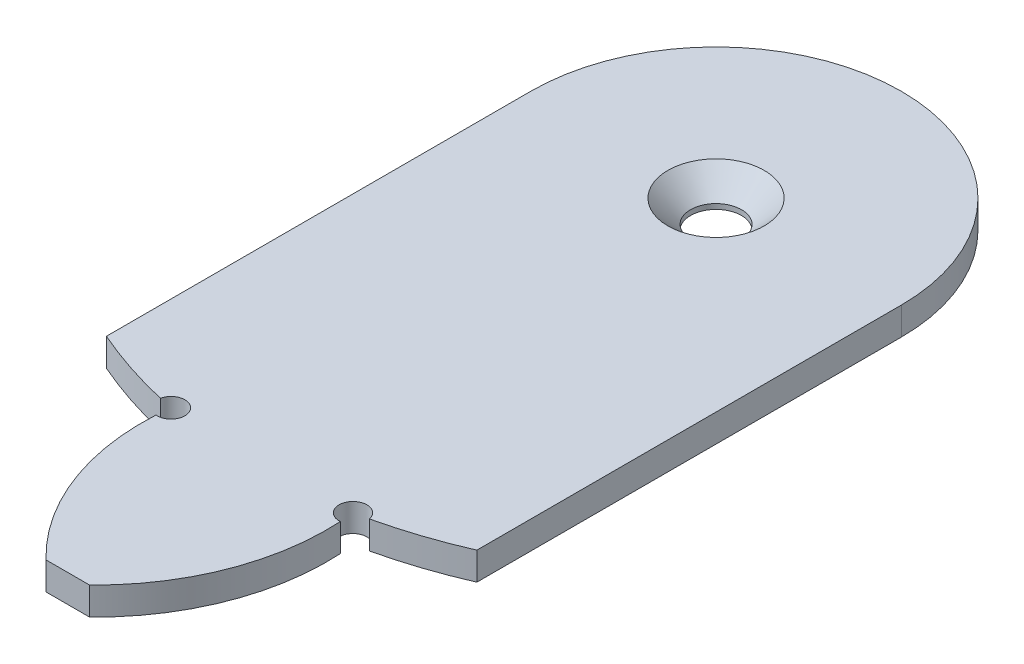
ISO-10303-21;
HEADER;
FILE_DESCRIPTION(('STEP AP214'),'2;1');
FILE_NAME('part.step','',(''),(''),'','','');
FILE_SCHEMA(('AUTOMOTIVE_DESIGN { 1 0 10303 214 1 1 1 1 }'));
ENDSEC;
DATA;
#1=APPLICATION_CONTEXT('core data for automotive mechanical design processes');
#2=APPLICATION_PROTOCOL_DEFINITION('international standard','automotive_design',2000,#1);
#3=PRODUCT_CONTEXT('',#1,'mechanical');
#4=PRODUCT('Part','Part','',(#3));
#5=PRODUCT_RELATED_PRODUCT_CATEGORY('part','',(#4));
#6=PRODUCT_DEFINITION_FORMATION('','',#4);
#7=PRODUCT_DEFINITION_CONTEXT('part definition',#1,'design');
#8=PRODUCT_DEFINITION('design','',#6,#7);
#9=PRODUCT_DEFINITION_SHAPE('','',#8);
#10=(LENGTH_UNIT() NAMED_UNIT(*) SI_UNIT(.MILLI.,.METRE.));
#11=(NAMED_UNIT(*) PLANE_ANGLE_UNIT() SI_UNIT($,.RADIAN.));
#12=(NAMED_UNIT(*) SI_UNIT($,.STERADIAN.) SOLID_ANGLE_UNIT());
#13=UNCERTAINTY_MEASURE_WITH_UNIT(LENGTH_MEASURE(1.E-05),#10,'distance_accuracy_value','');
#14=(GEOMETRIC_REPRESENTATION_CONTEXT(3) GLOBAL_UNCERTAINTY_ASSIGNED_CONTEXT((#13)) GLOBAL_UNIT_ASSIGNED_CONTEXT((#10,
#11,#12)) REPRESENTATION_CONTEXT('',''));
#15=CARTESIAN_POINT('',(0.,0.,0.));
#16=DIRECTION('',(0.,0.,1.));
#17=DIRECTION('',(1.,0.,0.));
#18=AXIS2_PLACEMENT_3D('',#15,#16,#17);
#19=CARTESIAN_POINT('',(15.,3.,-16.4173567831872));
#20=DIRECTION('',(0.,-1.,0.));
#21=DIRECTION('',(0.,0.,-1.));
#22=AXIS2_PLACEMENT_3D('',#19,#20,#21);
#23=CYLINDRICAL_SURFACE('',#22,25.);
#24=CARTESIAN_POINT('',(15.,0.,-16.4173567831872));
#25=DIRECTION('',(0.,1.,0.));
#26=DIRECTION('',(0.,0.,1.));
#27=AXIS2_PLACEMENT_3D('',#24,#25,#26);
#28=CIRCLE('',#27,25.);
#29=CARTESIAN_POINT('',(-9.95613776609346,0.,-17.8976229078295));
#30=VERTEX_POINT('',#29);
#31=CARTESIAN_POINT('',(-2.34935157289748,0.,1.58264321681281));
#32=VERTEX_POINT('',#31);
#33=EDGE_CURVE('E139',#30,#32,#28,.T.);
#34=ORIENTED_EDGE('',*,*,#33,.T.);
#35=DIRECTION('',(0.,-1.,0.));
#36=VECTOR('',#35,1.);
#37=CARTESIAN_POINT('',(-2.34935157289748,3.,1.58264321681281));
#38=LINE('',#37,#36);
#39=CARTESIAN_POINT('',(-2.34935157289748,3.,1.58264321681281));
#40=VERTEX_POINT('',#39);
#41=EDGE_CURVE('E11',#40,#32,#38,.T.);
#42=ORIENTED_EDGE('',*,*,#41,.F.);
#43=CARTESIAN_POINT('',(15.,3.,-16.4173567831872));
#44=DIRECTION('',(0.,1.,0.));
#45=DIRECTION('',(0.,0.,1.));
#46=AXIS2_PLACEMENT_3D('',#43,#44,#45);
#47=CIRCLE('',#46,25.);
#48=CARTESIAN_POINT('',(-9.95613776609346,3.,-17.8976229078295));
#49=VERTEX_POINT('',#48);
#50=EDGE_CURVE('E158',#49,#40,#47,.T.);
#51=ORIENTED_EDGE('',*,*,#50,.F.);
#52=DIRECTION('',(0.,-1.,0.));
#53=VECTOR('',#52,1.);
#54=CARTESIAN_POINT('',(-9.95613776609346,3.,-17.8976229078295));
#55=LINE('',#54,#53);
#56=EDGE_CURVE('E135',#49,#30,#55,.T.);
#57=ORIENTED_EDGE('',*,*,#56,.T.);
#58=EDGE_LOOP('',(#34,#42,#51,#57));
#59=FACE_BOUND('',#58,.T.);
#60=ADVANCED_FACE('F31',(#59),#23,.T.);
#61=CARTESIAN_POINT('',(-2.34935157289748,3.,1.58264321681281));
#62=DIRECTION('',(0.,0.,-1.));
#63=DIRECTION('',(-1.,0.,0.));
#64=AXIS2_PLACEMENT_3D('',#61,#62,#63);
#65=PLANE('',#64);
#66=DIRECTION('',(1.,0.,0.));
#67=VECTOR('',#66,1.);
#68=CARTESIAN_POINT('',(-2.34935157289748,0.,1.58264321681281));
#69=LINE('',#68,#67);
#70=CARTESIAN_POINT('',(2.34935157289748,0.,1.58264321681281));
#71=VERTEX_POINT('',#70);
#72=EDGE_CURVE('E142',#32,#71,#69,.T.);
#73=ORIENTED_EDGE('',*,*,#72,.T.);
#74=DIRECTION('',(0.,-1.,0.));
#75=VECTOR('',#74,1.);
#76=CARTESIAN_POINT('',(2.34935157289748,3.,1.58264321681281));
#77=LINE('',#76,#75);
#78=CARTESIAN_POINT('',(2.34935157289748,3.,1.58264321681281));
#79=VERTEX_POINT('',#78);
#80=EDGE_CURVE('E39',#79,#71,#77,.T.);
#81=ORIENTED_EDGE('',*,*,#80,.F.);
#82=DIRECTION('',(1.,0.,0.));
#83=VECTOR('',#82,1.);
#84=CARTESIAN_POINT('',(-2.34935157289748,3.,1.58264321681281));
#85=LINE('',#84,#83);
#86=EDGE_CURVE('E96',#40,#79,#85,.T.);
#87=ORIENTED_EDGE('',*,*,#86,.F.);
#88=ORIENTED_EDGE('',*,*,#41,.T.);
#89=EDGE_LOOP('',(#73,#81,#87,#88));
#90=FACE_BOUND('',#89,.T.);
#91=ADVANCED_FACE('F229',(#90),#65,.F.);
#92=CARTESIAN_POINT('',(-15.,3.,-16.4173567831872));
#93=DIRECTION('',(0.,-1.,0.));
#94=DIRECTION('',(0.,0.,-1.));
#95=AXIS2_PLACEMENT_3D('',#92,#93,#94);
#96=CYLINDRICAL_SURFACE('',#95,25.);
#97=CARTESIAN_POINT('',(-15.,0.,-16.4173567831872));
#98=DIRECTION('',(0.,1.,0.));
#99=DIRECTION('',(0.,0.,1.));
#100=AXIS2_PLACEMENT_3D('',#97,#98,#99);
#101=CIRCLE('',#100,25.);
#102=CARTESIAN_POINT('',(9.95613776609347,0.,-17.8976229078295));
#103=VERTEX_POINT('',#102);
#104=EDGE_CURVE('E145',#71,#103,#101,.T.);
#105=ORIENTED_EDGE('',*,*,#104,.T.);
#106=DIRECTION('',(0.,-1.,0.));
#107=VECTOR('',#106,1.);
#108=CARTESIAN_POINT('',(9.95613776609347,3.,-17.8976229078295));
#109=LINE('',#108,#107);
#110=CARTESIAN_POINT('',(9.95613776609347,3.,-17.8976229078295));
#111=VERTEX_POINT('',#110);
#112=EDGE_CURVE('E171',#111,#103,#109,.T.);
#113=ORIENTED_EDGE('',*,*,#112,.F.);
#114=CARTESIAN_POINT('',(-15.,3.,-16.4173567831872));
#115=DIRECTION('',(0.,1.,0.));
#116=DIRECTION('',(0.,0.,1.));
#117=AXIS2_PLACEMENT_3D('',#114,#115,#116);
#118=CIRCLE('',#117,25.);
#119=EDGE_CURVE('E179',#79,#111,#118,.T.);
#120=ORIENTED_EDGE('',*,*,#119,.F.);
#121=ORIENTED_EDGE('',*,*,#80,.T.);
#122=EDGE_LOOP('',(#105,#113,#120,#121));
#123=FACE_BOUND('',#122,.T.);
#124=ADVANCED_FACE('F177',(#123),#96,.T.);
#125=CARTESIAN_POINT('',(9.82244072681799,3.,-19.3916527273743));
#126=DIRECTION('',(0.,-1.,0.));
#127=DIRECTION('',(0.,0.,-1.));
#128=AXIS2_PLACEMENT_3D('',#125,#126,#127);
#129=CYLINDRICAL_SURFACE('',#128,1.5);
#130=CARTESIAN_POINT('',(9.82244072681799,0.,-19.3916527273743));
#131=DIRECTION('',(0.,-1.,0.));
#132=DIRECTION('',(0.,0.,1.));
#133=AXIS2_PLACEMENT_3D('',#130,#131,#132);
#134=CIRCLE('',#133,1.5);
#135=CARTESIAN_POINT('',(11.2886262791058,0.,-19.7083543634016));
#136=VERTEX_POINT('',#135);
#137=EDGE_CURVE('E147',#103,#136,#134,.T.);
#138=ORIENTED_EDGE('',*,*,#137,.T.);
#139=DIRECTION('',(0.,-1.,0.));
#140=VECTOR('',#139,1.);
#141=CARTESIAN_POINT('',(11.2886262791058,3.,-19.7083543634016));
#142=LINE('',#141,#140);
#143=CARTESIAN_POINT('',(11.2886262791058,3.,-19.7083543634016));
#144=VERTEX_POINT('',#143);
#145=EDGE_CURVE('E168',#144,#136,#142,.T.);
#146=ORIENTED_EDGE('',*,*,#145,.F.);
#147=CARTESIAN_POINT('',(9.82244072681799,3.,-19.3916527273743));
#148=DIRECTION('',(0.,-1.,0.));
#149=DIRECTION('',(0.,0.,1.));
#150=AXIS2_PLACEMENT_3D('',#147,#148,#149);
#151=CIRCLE('',#150,1.5);
#152=EDGE_CURVE('E197',#111,#144,#151,.T.);
#153=ORIENTED_EDGE('',*,*,#152,.F.);
#154=ORIENTED_EDGE('',*,*,#112,.T.);
#155=EDGE_LOOP('',(#138,#146,#153,#154));
#156=FACE_BOUND('',#155,.T.);
#157=ADVANCED_FACE('F188',(#156),#129,.F.);
#158=CARTESIAN_POINT('',(0.,3.,-68.4173567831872));
#159=DIRECTION('',(0.,-1.,0.));
#160=DIRECTION('',(0.,0.,-1.));
#161=AXIS2_PLACEMENT_3D('',#158,#159,#160);
#162=CYLINDRICAL_SURFACE('',#161,50.);
#163=CARTESIAN_POINT('',(0.,0.,-68.4173567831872));
#164=DIRECTION('',(0.,1.,0.));
#165=DIRECTION('',(0.,0.,1.));
#166=AXIS2_PLACEMENT_3D('',#163,#164,#165);
#167=CIRCLE('',#166,50.);
#168=CARTESIAN_POINT('',(20.,0.,-22.5915998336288));
#169=VERTEX_POINT('',#168);
#170=EDGE_CURVE('E149',#136,#169,#167,.T.);
#171=ORIENTED_EDGE('',*,*,#170,.T.);
#172=DIRECTION('',(0.,-1.,0.));
#173=VECTOR('',#172,1.);
#174=CARTESIAN_POINT('',(20.,3.,-22.5915998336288));
#175=LINE('',#174,#173);
#176=CARTESIAN_POINT('',(20.,3.,-22.5915998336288));
#177=VERTEX_POINT('',#176);
#178=EDGE_CURVE('E165',#177,#169,#175,.T.);
#179=ORIENTED_EDGE('',*,*,#178,.F.);
#180=CARTESIAN_POINT('',(0.,3.,-68.4173567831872));
#181=DIRECTION('',(0.,1.,0.));
#182=DIRECTION('',(0.,0.,1.));
#183=AXIS2_PLACEMENT_3D('',#180,#181,#182);
#184=CIRCLE('',#183,50.);
#185=EDGE_CURVE('E194',#144,#177,#184,.T.);
#186=ORIENTED_EDGE('',*,*,#185,.F.);
#187=ORIENTED_EDGE('',*,*,#145,.T.);
#188=EDGE_LOOP('',(#171,#179,#186,#187));
#189=FACE_BOUND('',#188,.T.);
#190=ADVANCED_FACE('F192',(#189),#162,.T.);
#191=CARTESIAN_POINT('',(20.,3.,-68.4173567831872));
#192=DIRECTION('',(-1.,0.,0.));
#193=DIRECTION('',(0.,0.,1.));
#194=AXIS2_PLACEMENT_3D('',#191,#192,#193);
#195=PLANE('',#194);
#196=DIRECTION('',(0.,0.,-1.));
#197=VECTOR('',#196,1.);
#198=CARTESIAN_POINT('',(20.,0.,-68.4173567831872));
#199=LINE('',#198,#197);
#200=CARTESIAN_POINT('',(20.,0.,-68.4173567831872));
#201=VERTEX_POINT('',#200);
#202=EDGE_CURVE('E151',#169,#201,#199,.T.);
#203=ORIENTED_EDGE('',*,*,#202,.T.);
#204=DIRECTION('',(0.,-1.,0.));
#205=VECTOR('',#204,1.);
#206=CARTESIAN_POINT('',(20.,3.,-68.4173567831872));
#207=LINE('',#206,#205);
#208=CARTESIAN_POINT('',(20.,3.,-68.4173567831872));
#209=VERTEX_POINT('',#208);
#210=EDGE_CURVE('E162',#209,#201,#207,.T.);
#211=ORIENTED_EDGE('',*,*,#210,.F.);
#212=DIRECTION('',(0.,0.,-1.));
#213=VECTOR('',#212,1.);
#214=CARTESIAN_POINT('',(20.,3.,-68.4173567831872));
#215=LINE('',#214,#213);
#216=EDGE_CURVE('E196',#177,#209,#215,.T.);
#217=ORIENTED_EDGE('',*,*,#216,.F.);
#218=ORIENTED_EDGE('',*,*,#178,.T.);
#219=EDGE_LOOP('',(#203,#211,#217,#218));
#220=FACE_BOUND('',#219,.T.);
#221=ADVANCED_FACE('F241',(#220),#195,.F.);
#222=CARTESIAN_POINT('',(0.,3.,-68.4173567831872));
#223=DIRECTION('',(0.,-1.,0.));
#224=DIRECTION('',(0.,0.,-1.));
#225=AXIS2_PLACEMENT_3D('',#222,#223,#224);
#226=CYLINDRICAL_SURFACE('',#225,20.);
#227=CARTESIAN_POINT('',(0.,0.,-68.4173567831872));
#228=DIRECTION('',(0.,1.,0.));
#229=DIRECTION('',(0.,0.,1.));
#230=AXIS2_PLACEMENT_3D('',#227,#228,#229);
#231=CIRCLE('',#230,20.);
#232=CARTESIAN_POINT('',(-20.,0.,-68.4173567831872));
#233=VERTEX_POINT('',#232);
#234=EDGE_CURVE('E153',#201,#233,#231,.T.);
#235=ORIENTED_EDGE('',*,*,#234,.T.);
#236=DIRECTION('',(0.,-1.,0.));
#237=VECTOR('',#236,1.);
#238=CARTESIAN_POINT('',(-20.,3.,-68.4173567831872));
#239=LINE('',#238,#237);
#240=CARTESIAN_POINT('',(-20.,3.,-68.4173567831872));
#241=VERTEX_POINT('',#240);
#242=EDGE_CURVE('E130',#241,#233,#239,.T.);
#243=ORIENTED_EDGE('',*,*,#242,.F.);
#244=CARTESIAN_POINT('',(0.,3.,-68.4173567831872));
#245=DIRECTION('',(0.,1.,0.));
#246=DIRECTION('',(0.,0.,1.));
#247=AXIS2_PLACEMENT_3D('',#244,#245,#246);
#248=CIRCLE('',#247,20.);
#249=EDGE_CURVE('E121',#209,#241,#248,.T.);
#250=ORIENTED_EDGE('',*,*,#249,.F.);
#251=ORIENTED_EDGE('',*,*,#210,.T.);
#252=EDGE_LOOP('',(#235,#243,#250,#251));
#253=FACE_BOUND('',#252,.T.);
#254=ADVANCED_FACE('F238',(#253),#226,.T.);
#255=CARTESIAN_POINT('',(-20.,3.,-68.4173567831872));
#256=DIRECTION('',(1.,0.,0.));
#257=DIRECTION('',(0.,0.,-1.));
#258=AXIS2_PLACEMENT_3D('',#255,#256,#257);
#259=PLANE('',#258);
#260=DIRECTION('',(0.,0.,1.));
#261=VECTOR('',#260,1.);
#262=CARTESIAN_POINT('',(-20.,0.,-68.4173567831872));
#263=LINE('',#262,#261);
#264=CARTESIAN_POINT('',(-20.,0.,-22.5915998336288));
#265=VERTEX_POINT('',#264);
#266=EDGE_CURVE('E129',#233,#265,#263,.T.);
#267=ORIENTED_EDGE('',*,*,#266,.T.);
#268=DIRECTION('',(0.,-1.,0.));
#269=VECTOR('',#268,1.);
#270=CARTESIAN_POINT('',(-20.,3.,-22.5915998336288));
#271=LINE('',#270,#269);
#272=CARTESIAN_POINT('',(-20.,3.,-22.5915998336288));
#273=VERTEX_POINT('',#272);
#274=EDGE_CURVE('E126',#273,#265,#271,.T.);
#275=ORIENTED_EDGE('',*,*,#274,.F.);
#276=DIRECTION('',(0.,0.,1.));
#277=VECTOR('',#276,1.);
#278=CARTESIAN_POINT('',(-20.,3.,-68.4173567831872));
#279=LINE('',#278,#277);
#280=EDGE_CURVE('E115',#241,#273,#279,.T.);
#281=ORIENTED_EDGE('',*,*,#280,.F.);
#282=ORIENTED_EDGE('',*,*,#242,.T.);
#283=EDGE_LOOP('',(#267,#275,#281,#282));
#284=FACE_BOUND('',#283,.T.);
#285=ADVANCED_FACE('F127',(#284),#259,.F.);
#286=CARTESIAN_POINT('',(0.,3.,-68.4173567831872));
#287=DIRECTION('',(0.,-1.,0.));
#288=DIRECTION('',(0.,0.,-1.));
#289=AXIS2_PLACEMENT_3D('',#286,#287,#288);
#290=CYLINDRICAL_SURFACE('',#289,50.);
#291=CARTESIAN_POINT('',(0.,0.,-68.4173567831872));
#292=DIRECTION('',(0.,1.,0.));
#293=DIRECTION('',(0.,0.,1.));
#294=AXIS2_PLACEMENT_3D('',#291,#292,#293);
#295=CIRCLE('',#294,50.);
#296=CARTESIAN_POINT('',(-11.2886262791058,0.,-19.7083543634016));
#297=VERTEX_POINT('',#296);
#298=EDGE_CURVE('E82',#265,#297,#295,.T.);
#299=ORIENTED_EDGE('',*,*,#298,.T.);
#300=DIRECTION('',(0.,-1.,0.));
#301=VECTOR('',#300,1.);
#302=CARTESIAN_POINT('',(-11.2886262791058,3.,-19.7083543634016));
#303=LINE('',#302,#301);
#304=CARTESIAN_POINT('',(-11.2886262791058,3.,-19.7083543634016));
#305=VERTEX_POINT('',#304);
#306=EDGE_CURVE('E131',#305,#297,#303,.T.);
#307=ORIENTED_EDGE('',*,*,#306,.F.);
#308=CARTESIAN_POINT('',(0.,3.,-68.4173567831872));
#309=DIRECTION('',(0.,1.,0.));
#310=DIRECTION('',(0.,0.,1.));
#311=AXIS2_PLACEMENT_3D('',#308,#309,#310);
#312=CIRCLE('',#311,50.);
#313=EDGE_CURVE('E119',#273,#305,#312,.T.);
#314=ORIENTED_EDGE('',*,*,#313,.F.);
#315=ORIENTED_EDGE('',*,*,#274,.T.);
#316=EDGE_LOOP('',(#299,#307,#314,#315));
#317=FACE_BOUND('',#316,.T.);
#318=ADVANCED_FACE('F133',(#317),#290,.T.);
#319=CARTESIAN_POINT('',(-9.82244072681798,3.,-19.3916527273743));
#320=DIRECTION('',(0.,-1.,0.));
#321=DIRECTION('',(0.,0.,-1.));
#322=AXIS2_PLACEMENT_3D('',#319,#320,#321);
#323=CYLINDRICAL_SURFACE('',#322,1.5);
#324=CARTESIAN_POINT('',(-9.82244072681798,0.,-19.3916527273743));
#325=DIRECTION('',(0.,-1.,0.));
#326=DIRECTION('',(0.,0.,1.));
#327=AXIS2_PLACEMENT_3D('',#324,#325,#326);
#328=CIRCLE('',#327,1.5);
#329=EDGE_CURVE('E88',#297,#30,#328,.T.);
#330=ORIENTED_EDGE('',*,*,#329,.T.);
#331=ORIENTED_EDGE('',*,*,#56,.F.);
#332=CARTESIAN_POINT('',(-9.82244072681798,3.,-19.3916527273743));
#333=DIRECTION('',(0.,-1.,0.));
#334=DIRECTION('',(0.,0.,1.));
#335=AXIS2_PLACEMENT_3D('',#332,#333,#334);
#336=CIRCLE('',#335,1.5);
#337=EDGE_CURVE('E47',#305,#49,#336,.T.);
#338=ORIENTED_EDGE('',*,*,#337,.F.);
#339=ORIENTED_EDGE('',*,*,#306,.T.);
#340=EDGE_LOOP('',(#330,#331,#338,#339));
#341=FACE_BOUND('',#340,.T.);
#342=ADVANCED_FACE('F217',(#341),#323,.F.);
#343=CARTESIAN_POINT('',(15.,3.,-16.4173567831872));
#344=DIRECTION('',(0.,1.,0.));
#345=DIRECTION('',(0.,0.,1.));
#346=AXIS2_PLACEMENT_3D('',#343,#344,#345);
#347=PLANE('',#346);
#348=CARTESIAN_POINT('',(0.,3.,-68.4173567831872));
#349=DIRECTION('',(0.,1.,0.));
#350=DIRECTION('',(0.,0.,1.));
#351=AXIS2_PLACEMENT_3D('',#348,#349,#350);
#352=CIRCLE('',#351,5.2);
#353=CARTESIAN_POINT('',(0.,3.,-63.2173567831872));
#354=VERTEX_POINT('',#353);
#355=EDGE_CURVE('E210',#354,#354,#352,.T.);
#356=ORIENTED_EDGE('',*,*,#355,.F.);
#357=EDGE_LOOP('',(#356));
#358=FACE_BOUND('',#357,.T.);
#359=ORIENTED_EDGE('',*,*,#50,.T.);
#360=ORIENTED_EDGE('',*,*,#86,.T.);
#361=ORIENTED_EDGE('',*,*,#119,.T.);
#362=ORIENTED_EDGE('',*,*,#152,.T.);
#363=ORIENTED_EDGE('',*,*,#185,.T.);
#364=ORIENTED_EDGE('',*,*,#216,.T.);
#365=ORIENTED_EDGE('',*,*,#249,.T.);
#366=ORIENTED_EDGE('',*,*,#280,.T.);
#367=ORIENTED_EDGE('',*,*,#313,.T.);
#368=ORIENTED_EDGE('',*,*,#337,.T.);
#369=EDGE_LOOP('',(#359,#360,#361,#362,#363,#364,#365,#366,#367,#368));
#370=FACE_BOUND('',#369,.T.);
#371=ADVANCED_FACE('F117',(#358,#370),#347,.T.);
#372=CARTESIAN_POINT('',(15.,0.,-16.4173567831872));
#373=DIRECTION('',(0.,1.,0.));
#374=DIRECTION('',(0.,0.,1.));
#375=AXIS2_PLACEMENT_3D('',#372,#373,#374);
#376=PLANE('',#375);
#377=CARTESIAN_POINT('',(0.,0.,-68.4173567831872));
#378=DIRECTION('',(0.,1.,0.));
#379=DIRECTION('',(0.,0.,1.));
#380=AXIS2_PLACEMENT_3D('',#377,#378,#379);
#381=CIRCLE('',#380,2.75);
#382=CARTESIAN_POINT('',(0.,0.,-65.6673567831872));
#383=VERTEX_POINT('',#382);
#384=EDGE_CURVE('E143',#383,#383,#381,.T.);
#385=ORIENTED_EDGE('',*,*,#384,.T.);
#386=EDGE_LOOP('',(#385));
#387=FACE_BOUND('',#386,.T.);
#388=ORIENTED_EDGE('',*,*,#33,.F.);
#389=ORIENTED_EDGE('',*,*,#329,.F.);
#390=ORIENTED_EDGE('',*,*,#298,.F.);
#391=ORIENTED_EDGE('',*,*,#266,.F.);
#392=ORIENTED_EDGE('',*,*,#234,.F.);
#393=ORIENTED_EDGE('',*,*,#202,.F.);
#394=ORIENTED_EDGE('',*,*,#170,.F.);
#395=ORIENTED_EDGE('',*,*,#137,.F.);
#396=ORIENTED_EDGE('',*,*,#104,.F.);
#397=ORIENTED_EDGE('',*,*,#72,.F.);
#398=EDGE_LOOP('',(#388,#389,#390,#391,#392,#393,#394,#395,#396,#397));
#399=FACE_BOUND('',#398,.T.);
#400=ADVANCED_FACE('F183',(#387,#399),#376,.F.);
#401=CARTESIAN_POINT('',(0.,3.,-68.4173567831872));
#402=DIRECTION('',(0.,1.,0.));
#403=DIRECTION('',(0.,0.,1.));
#404=AXIS2_PLACEMENT_3D('',#401,#402,#403);
#405=CYLINDRICAL_SURFACE('',#404,2.75);
#406=ORIENTED_EDGE('',*,*,#384,.F.);
#407=EDGE_LOOP('',(#406));
#408=FACE_BOUND('',#407,.T.);
#409=CARTESIAN_POINT('',(0.,0.549999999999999,-68.4173567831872));
#410=DIRECTION('',(0.,1.,0.));
#411=DIRECTION('',(0.,0.,1.));
#412=AXIS2_PLACEMENT_3D('',#409,#410,#411);
#413=CIRCLE('',#412,2.75);
#414=CARTESIAN_POINT('',(0.,0.549999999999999,-65.6673567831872));
#415=VERTEX_POINT('',#414);
#416=EDGE_CURVE('E207',#415,#415,#413,.T.);
#417=ORIENTED_EDGE('',*,*,#416,.T.);
#418=EDGE_LOOP('',(#417));
#419=FACE_BOUND('',#418,.T.);
#420=ADVANCED_FACE('F223',(#408,#419),#405,.F.);
#421=CARTESIAN_POINT('',(0.,3.,-68.4173567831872));
#422=DIRECTION('',(0.,1.,0.));
#423=DIRECTION('',(0.,0.,1.));
#424=AXIS2_PLACEMENT_3D('',#421,#422,#423);
#425=CONICAL_SURFACE('',#424,5.2,0.785398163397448);
#426=ORIENTED_EDGE('',*,*,#416,.F.);
#427=EDGE_LOOP('',(#426));
#428=FACE_BOUND('',#427,.T.);
#429=ORIENTED_EDGE('',*,*,#355,.T.);
#430=EDGE_LOOP('',(#429));
#431=FACE_BOUND('',#430,.T.);
#432=ADVANCED_FACE('F214',(#428,#431),#425,.F.);
#433=CLOSED_SHELL('',(#60,#91,#124,#157,#190,#221,#254,#285,#318,#342,#371,#400,#420,#432));
#434=MANIFOLD_SOLID_BREP('B2',#433);
#435=ADVANCED_BREP_SHAPE_REPRESENTATION('',(#18,#434),#14);
#436=SHAPE_DEFINITION_REPRESENTATION(#9,#435);
ENDSEC;
END-ISO-10303-21;
